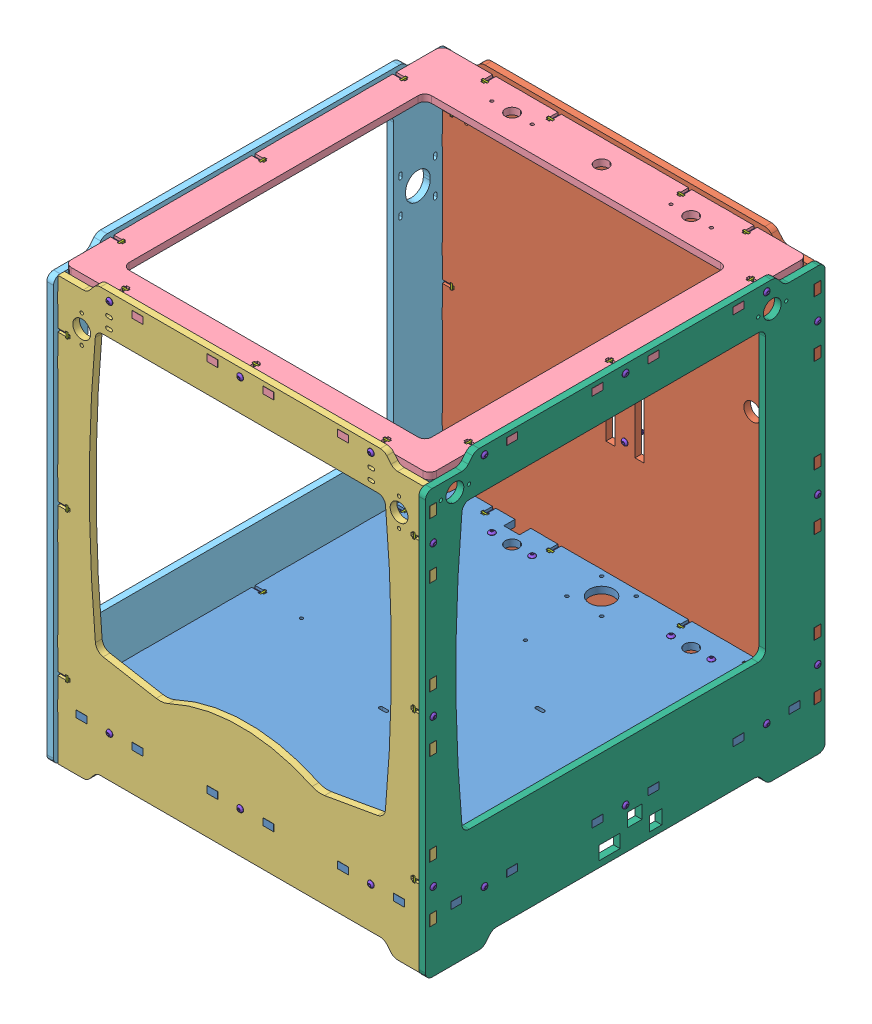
SolidWorks assembly UM_1000_ASM.sldasm, configuration Default (file format 5000). Lengths in mm.
Overall size (342.1 388 473).
103 component instances, 13 part files, 0 mates.
Components (placement in the parent):
- UM_1001-1: UM_1001.sldprt [Default] at (0 46.9 0) x (-1 0 0) z (0 0 1) size (338.5 6 349.7)
- UM_1002-1: UM_1002.sldprt [Default] at (0 194 -171.75) x (1 0 0) z (0 -1 0) size (338.5 6 388)
- UM_1003-1: UM_1003.sldprt [Default] at (0 194 171.75) x (1 0 0) z (0 -1 0) size (338.5 6 388)
- UM_1004-1: UM_1004.sldprt [Default] at (0 381 0) size (338.5 6 349.7)
- UM_1005-1: UM_1005.sldprt [Default] at (-166.15 194 0) x (0 0 1) z (0 -1 0) size (357.1 6 388)
- UM_1006-1: UM_1006.sldprt [Default] at (166.15 194 0) x (0 0 1) z (0 -1 0) size (357.1 6 388)
- DIN562_M3-1: DIN562_M3.sldprt [Default] at (155.25 381 -126.05) x (0 1 0) z (0 0 1) size (5.5 1.6 5.5)
- ISO7380_M3X16-2: ISO7380_M3X16.sldprt [Default] at (169.15 381 -126.05) x (0 -1 0) z (0 0 1) size (5.77 17.9 5.75)
- DIN562_M3-2: DIN562_M3.sldprt [Default] at (155.25 381 0) x (0 1 0) z (0 0 1) size (5.5 1.6 5.5)
- DIN562_M3-3: DIN562_M3.sldprt [Default] at (155.25 381 126.05) x (0 1 0) z (0 0 1) size (5.5 1.6 5.5)
- DIN562_M3-4: DIN562_M3.sldprt [Default] at (116.75 381 160.85) x (1 0 0) z (0 1 0) size (5.5 1.6 5.5)
- DIN562_M3-5: DIN562_M3.sldprt [Default] at (0 381 160.85) x (1 0 0) z (0 1 0) size (5.5 1.6 5.5)
- DIN562_M3-6: DIN562_M3.sldprt [Default] at (-116.75 381 160.85) x (1 0 0) z (0 1 0) size (5.5 1.6 5.5)
- DIN562_M3-7: DIN562_M3.sldprt [Default] at (-155.25 381 126.05) x (0 -1 0) z (0 0 1) size (5.5 1.6 5.5)
- DIN562_M3-8: DIN562_M3.sldprt [Default] at (-155.25 381 0) x (0 -1 0) z (0 0 1) size (5.5 1.6 5.5)
- DIN562_M3-9: DIN562_M3.sldprt [Default] at (-155.25 381 -126.05) x (0 -1 0) z (0 0 1) size (5.5 1.6 5.5)
- DIN562_M3-10: DIN562_M3.sldprt [Default] at (-154.65 46.9 126.05) x (0 1 0) z (0 0 1) size (5.5 1.6 5.5)
- DIN562_M3-11: DIN562_M3.sldprt [Default] at (-154.65 46.9 0) x (0 1 0) z (0 0 1) size (5.5 1.6 5.5)
- DIN562_M3-12: DIN562_M3.sldprt [Default] at (-154.65 46.9 -126.05) x (0 1 0) z (0 0 1) size (5.5 1.6 5.5)
- DIN562_M3-13: DIN562_M3.sldprt [Default] at (116.75 46.9 -160.25) x (1 0 0) z (0 1 0) size (5.5 1.6 5.5)
- DIN562_M3-14: DIN562_M3.sldprt [Default] at (58.35 46.9 -160.25) x (1 0 0) z (0 1 0) size (5.5 1.6 5.5)
- DIN562_M3-15: DIN562_M3.sldprt [Default] at (-116.75 46.9 -160.25) x (1 0 0) z (0 1 0) size (5.5 1.6 5.5)
- DIN562_M3-16: DIN562_M3.sldprt [Default] at (154.65 46.9 -126.05) x (0 -1 0) z (0 0 1) size (5.5 1.6 5.5)
- DIN562_M3-17: DIN562_M3.sldprt [Default] at (154.65 46.9 0) x (0 -1 0) z (0 0 1) size (5.5 1.6 5.5)
- DIN562_M3-18: DIN562_M3.sldprt [Default] at (154.65 46.9 126.05) x (0 -1 0) z (0 0 1) size (5.5 1.6 5.5)
- DIN562_M3-19: DIN562_M3.sldprt [Default] at (116.75 46.9 160.25) x (-1 0 0) z (0 1 0) size (5.5 1.6 5.5)
- DIN562_M3-20: DIN562_M3.sldprt [Default] at (0 46.9 160.25) x (-1 0 0) z (0 1 0) size (5.5 1.6 5.5)
- DIN562_M3-21: DIN562_M3.sldprt [Default] at (-116.75 46.9 160.25) x (-1 0 0) z (0 1 0) size (5.5 1.6 5.5)
- DIN562_M3-22: DIN562_M3.sldprt [Default] at (-155.25 69.8 171.75) x (0 -1 0) z (0 0 1) size (5.5 1.6 5.5)
- DIN562_M3-23: DIN562_M3.sldprt [Default] at (-155.25 201.5 171.75) x (0 -1 0) z (0 0 1) size (5.5 1.6 5.5)
- DIN562_M3-24: DIN562_M3.sldprt [Default] at (-155.25 335.6 171.75) x (0 -1 0) z (0 0 1) size (5.5 1.6 5.5)
- DIN562_M3-25: DIN562_M3.sldprt [Default] at (155.25 335.6 171.75) x (0 1 0) z (0 0 1) size (5.5 1.6 5.5)
- DIN562_M3-26: DIN562_M3.sldprt [Default] at (155.25 201.5 171.75) x (0 1 0) z (0 0 1) size (5.5 1.6 5.5)
- DIN562_M3-27: DIN562_M3.sldprt [Default] at (155.25 69.8 171.75) x (0 1 0) z (0 0 1) size (5.5 1.6 5.5)
- DIN562_M3-28: DIN562_M3.sldprt [Default] at (155.25 69.8 -171.75) x (0 1 0) z (0 0 1) size (5.5 1.6 5.5)
- DIN562_M3-29: DIN562_M3.sldprt [Default] at (155.25 201.5 -171.75) x (0 1 0) z (0 0 1) size (5.5 1.6 5.5)
- DIN562_M3-30: DIN562_M3.sldprt [Default] at (155.25 335.6 -171.75) x (0 1 0) z (0 0 1) size (5.5 1.6 5.5)
- DIN562_M3-31: DIN562_M3.sldprt [Default] at (-58.35 46.9 -160.85) x (-1 0 0) z (0 1 0) size (5.5 1.6 5.5)
- DIN562_M3-32: DIN562_M3.sldprt [Default] at (-155.25 69.8 -171.75) x (0 -1 0) z (0 0 1) size (5.5 1.6 5.5)
- DIN562_M3-33: DIN562_M3.sldprt [Default] at (-155.25 201.5 -171.75) x (0 -1 0) z (0 0 1) size (5.5 1.6 5.5)
- DIN562_M3-34: DIN562_M3.sldprt [Default] at (-155.25 335.6 -171.75) x (0 -1 0) z (0 0 1) size (5.5 1.6 5.5)
- DIN562_M3-35: DIN562_M3.sldprt [Default] at (-116.75 381 -160.85) x (-1 0 0) z (0 1 0) size (5.5 1.6 5.5)
- DIN562_M3-36: DIN562_M3.sldprt [Default] at (-58.35 381 -160.85) x (-1 0 0) z (0 1 0) size (5.5 1.6 5.5)
- DIN562_M3-37: DIN562_M3.sldprt [Default] at (58.35 381 -160.85) x (-1 0 0) z (0 1 0) size (5.5 1.6 5.5)
- DIN562_M3-38: DIN562_M3.sldprt [Default] at (116.75 381 -160.85) x (-1 0 0) z (0 1 0) size (5.5 1.6 5.5)
- ISO7380_M3X16-3: ISO7380_M3X16.sldprt [Default] at (169.15 381 0) x (0 -1 0) z (0 0 1) size (5.77 17.9 5.75)
- ISO7380_M3X16-4: ISO7380_M3X16.sldprt [Default] at (169.15 381 126.05) x (0 -1 0) z (0 0 1) size (5.77 17.9 5.75)
- ISO7380_M3X16-5: ISO7380_M3X16.sldprt [Default] at (169.15 335.6 171.75) x (0 -1 0) z (0 0 1) size (5.77 17.9 5.75)
- ISO7380_M3X16-6: ISO7380_M3X16.sldprt [Default] at (169.15 201.5 171.75) x (0 -1 0) z (0 0 1) size (5.77 17.9 5.75)
- ISO7380_M3X16-7: ISO7380_M3X16.sldprt [Default] at (169.15 69.8 171.75) x (0 -1 0) z (0 0 1) size (5.77 17.9 5.75)
- ISO7380_M3X16-8: ISO7380_M3X16.sldprt [Default] at (169.15 46.9 126.05) x (0 -1 0) z (0 0 1) size (5.77 17.9 5.75)
- ISO7380_M3X16-9: ISO7380_M3X16.sldprt [Default] at (169.15 46.9 0) x (0 -1 0) z (0 0 1) size (5.77 17.9 5.75)
- ISO7380_M3X16-10: ISO7380_M3X16.sldprt [Default] at (169.15 46.9 -126.05) x (0 -1 0) z (0 0 1) size (5.77 17.9 5.75)
- ISO7380_M3X16-11: ISO7380_M3X16.sldprt [Default] at (169.15 69.8 -171.75) x (0 -1 0) z (0 0 1) size (5.77 17.9 5.75)
- ISO7380_M3X16-12: ISO7380_M3X16.sldprt [Default] at (169.15 201.5 -171.75) x (0 -1 0) z (0 0 1) size (5.77 17.9 5.75)
- ISO7380_M3X16-13: ISO7380_M3X16.sldprt [Default] at (169.15 335.6 -171.75) x (0 -1 0) z (0 0 1) size (5.77 17.9 5.75)
- ISO7380_M3X16-14: ISO7380_M3X16.sldprt [Default] at (-169.15 381 126.05) x (0 1 0) z (0 0 1) size (5.77 17.9 5.75)
- ISO7380_M3X16-15: ISO7380_M3X16.sldprt [Default] at (-169.15 381 0) x (0 1 0) z (0 0 1) size (5.77 17.9 5.75)
- ISO7380_M3X16-16: ISO7380_M3X16.sldprt [Default] at (-169.15 381 -126.05) x (0 1 0) z (0 0 1) size (5.77 17.9 5.75)
- ISO7380_M3X16-17: ISO7380_M3X16.sldprt [Default] at (-169.15 335.6 -171.75) x (0 1 0) z (0 0 1) size (5.77 17.9 5.75)
- ISO7380_M3X16-18: ISO7380_M3X16.sldprt [Default] at (-169.15 201.5 -171.75) x (0 1 0) z (0 0 1) size (5.77 17.9 5.75)
- ISO7380_M3X16-19: ISO7380_M3X16.sldprt [Default] at (-169.15 69.8 -171.75) x (0 1 0) z (0 0 1) size (5.77 17.9 5.75)
- ISO7380_M3X16-20: ISO7380_M3X16.sldprt [Default] at (-169.15 46.9 -126.05) x (0 1 0) z (0 0 1) size (5.77 17.9 5.75)
- ISO7380_M3X16-21: ISO7380_M3X16.sldprt [Default] at (-169.15 46.9 0) x (0 1 0) z (0 0 1) size (5.77 17.9 5.75)
- ISO7380_M3X16-22: ISO7380_M3X16.sldprt [Default] at (-169.15 46.9 126.05) x (0 1 0) z (0 0 1) size (5.77 17.9 5.75)
- ISO7380_M3X16-23: ISO7380_M3X16.sldprt [Default] at (-169.15 69.8 171.75) x (0 1 0) z (0 0 1) size (5.77 17.9 5.75)
- ISO7380_M3X16-24: ISO7380_M3X16.sldprt [Default] at (-169.15 201.5 171.75) x (0 1 0) z (0 0 1) size (5.77 17.9 5.75)
- ISO7380_M3X16-25: ISO7380_M3X16.sldprt [Default] at (-169.15 335.6 171.75) x (0 1 0) z (0 0 1) size (5.77 17.9 5.75)
- ISO7380_M3X16-26: ISO7380_M3X16.sldprt [Default] at (-116.75 381 -174.75) x (1 0 0) z (0 1 0) size (5.77 17.9 5.75)
- ISO7380_M3X16-27: ISO7380_M3X16.sldprt [Default] at (-58.35 381 -174.75) x (1 0 0) z (0 1 0) size (5.77 17.9 5.75)
- ISO7380_M3X16-28: ISO7380_M3X16.sldprt [Default] at (58.35 381 -174.75) x (1 0 0) z (0 1 0) size (5.77 17.9 5.75)
- ISO7380_M3X16-29: ISO7380_M3X16.sldprt [Default] at (116.75 381 -174.75) x (1 0 0) z (0 1 0) size (5.77 17.9 5.75)
- ISO7380_M3X16-30: ISO7380_M3X16.sldprt [Default] at (116.75 46.9 -174.75) x (1 0 0) z (0 1 0) size (5.77 17.9 5.75)
- ISO7380_M3X16-31: ISO7380_M3X16.sldprt [Default] at (58.35 46.9 -174.75) x (1 0 0) z (0 1 0) size (5.77 17.9 5.75)
- ISO7380_M3X16-32: ISO7380_M3X16.sldprt [Default] at (-58.35 46.9 -174.75) x (1 0 0) z (0 1 0) size (5.77 17.9 5.75)
- ISO7380_M3X16-33: ISO7380_M3X16.sldprt [Default] at (-116.75 46.9 -174.75) x (1 0 0) z (0 1 0) size (5.77 17.9 5.75)
- ISO7380_M3X16-34: ISO7380_M3X16.sldprt [Default] at (-116.75 381 174.75) x (-1 0 0) z (0 1 0) size (5.77 17.9 5.75)
- ISO7380_M3X16-35: ISO7380_M3X16.sldprt [Default] at (0 381 174.75) x (-1 0 0) z (0 1 0) size (5.77 17.9 5.75)
- ISO7380_M3X16-36: ISO7380_M3X16.sldprt [Default] at (116.75 381 174.75) x (-1 0 0) z (0 1 0) size (5.77 17.9 5.75)
- ISO7380_M3X16-37: ISO7380_M3X16.sldprt [Default] at (116.75 46.9 174.75) x (-1 0 0) z (0 1 0) size (5.77 17.9 5.75)
- ISO7380_M3X16-38: ISO7380_M3X16.sldprt [Default] at (0 46.9 174.75) x (-1 0 0) z (0 1 0) size (5.77 17.9 5.75)
- ISO7380_M3X16-39: ISO7380_M3X16.sldprt [Default] at (-116.75 46.9 174.75) x (-1 0 0) z (0 1 0) size (5.77 17.9 5.75)
- ISO7380_M3X16-40: ISO7380_M3X16.sldprt [Default] at (0 203.4 -168.75) x (-1 0 0) z (0 1 0) size (5.77 17.9 5.75)
- ISO7380_M3X16-41: ISO7380_M3X16.sldprt [Default] at (0 158.8 -168.75) x (-1 0 0) z (0 1 0) size (5.77 17.9 5.75)
- DIN985_M3-1: DIN985_M3.sldprt [Default] at (0 203.4 -183.15) size (6.35 5.5 4)
- DIN985_M3-2: DIN985_M3.sldprt [Default] at (0 158.8 -183.15) size (6.35 5.5 4)
- UM_0201-1: UM_0201.sldprt [Default] at (0 181.1 -177.75) x (1 0 0) z (0 1 0) size (52 6 67.5)
- UM_0202-1: UM_0202.sldprt [Default] at (-80 40.9 -147.95) x (0 0 -1) z (1 0 0) size (16 6 52)
- UM_0202-2: UM_0202.sldprt [Default] at (80 40.9 -147.95) x (0 0 -1) z (1 0 0) size (16 6 52)
- ISO7380_M3X16-42: ISO7380_M3X16.sldprt [Default] at (98 49.9 -147.95) size (5.77 17.9 5.75)
- ISO7380_M3X16-43: ISO7380_M3X16.sldprt [Default] at (62 49.9 -147.95) size (5.77 17.9 5.75)
- ISO7380_M3X16-44: ISO7380_M3X16.sldprt [Default] at (-62 49.9 -147.95) size (5.77 17.9 5.75)
- ISO7380_M3X16-45: ISO7380_M3X16.sldprt [Default] at (-98 49.9 -147.95) size (5.77 17.9 5.75)
- DIN985_M3-3: DIN985_M3.sldprt [Default] at (98 35.5 -147.95) x (-1 0 0) z (0 1 0) size (6.35 5.5 4)
- DIN985_M3-4: DIN985_M3.sldprt [Default] at (62 35.5 -147.95) x (-1 0 0) z (0 1 0) size (6.35 5.5 4)
- DIN985_M3-5: DIN985_M3.sldprt [Default] at (-62 35.5 -147.95) x (-1 0 0) z (0 1 0) size (6.35 5.5 4)
- DIN985_M3-6: DIN985_M3.sldprt [Default] at (-98 35.5 -147.95) x (-1 0 0) z (0 1 0) size (6.35 5.5 4)
- UM_7000_ASM-1: UM_7000_ASM.sldasm [Default] at (-13 174.85 -231.65) x (0 0 -1) z (1 0 0) size (125.6 51.61 50)
  - UM_7001-1: UM_7001.sldprt [Default] x (1 0 0) z (0 1 0) size (125.6 6 51.5)
  - UM_7002-1: UM_7002.sldprt [Default] at (-37.5132 1.61 13) x (0 0 -1) z (0 -1 0) size (50 6 25)
  - UM_7001-2: UM_7001.sldprt [Default] at (0 0 26) x (1 0 0) z (0 1 0) size (125.6 6 51.5)
  - UM_7002-2: UM_7002.sldprt [Default] at (7.0868 1.61 13) x (0 0 -1) z (0 -1 0) size (50 6 25)
  - UM_7002-3: UM_7002.sldprt [Default] at (51.7868 1.61 13) x (0 0 -1) z (0 -1 0) size (50 6 25)
